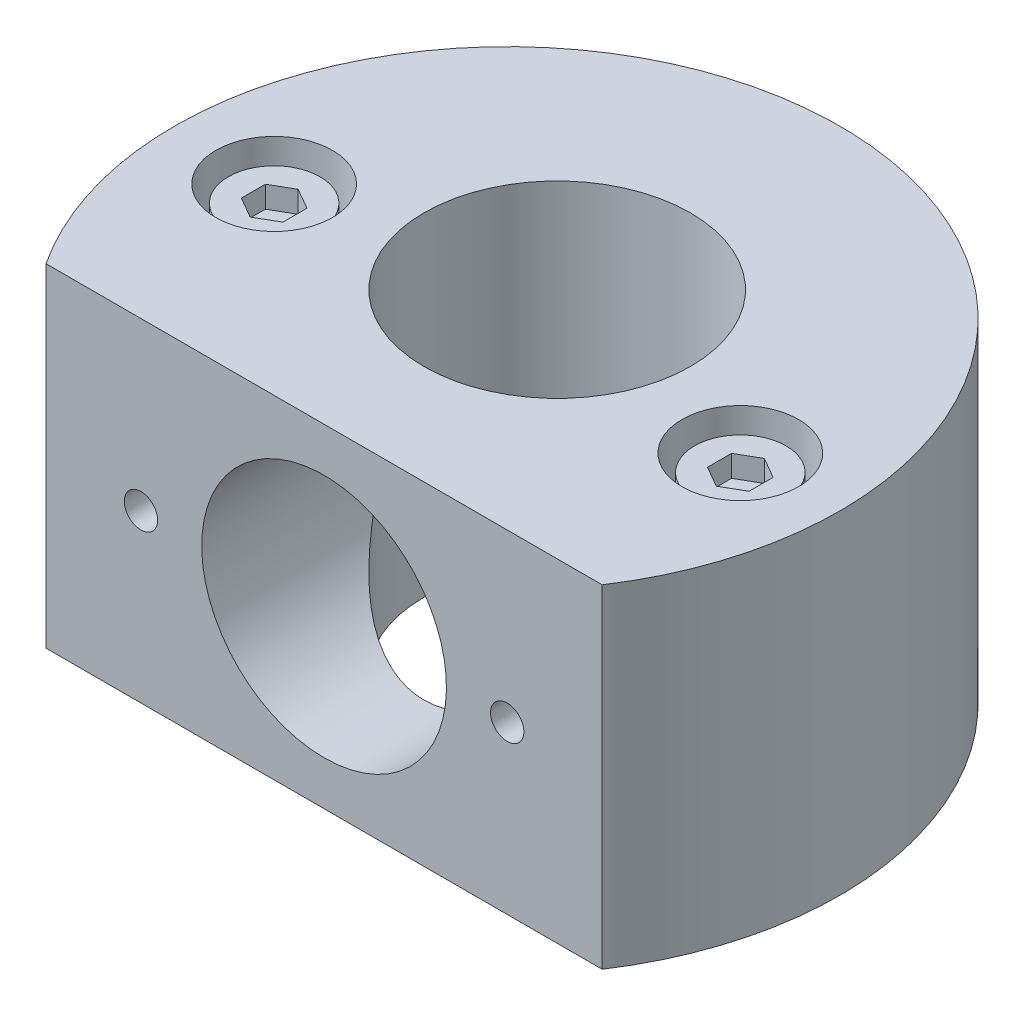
ISO-10303-21;
HEADER;
FILE_DESCRIPTION(('STEP AP214'),'2;1');
FILE_NAME('part.step','',(''),(''),'','','');
FILE_SCHEMA(('AUTOMOTIVE_DESIGN { 1 0 10303 214 1 1 1 1 }'));
ENDSEC;
DATA;
#1=APPLICATION_CONTEXT('core data for automotive mechanical design processes');
#2=APPLICATION_PROTOCOL_DEFINITION('international standard','automotive_design',2000,#1);
#3=PRODUCT_CONTEXT('',#1,'mechanical');
#4=PRODUCT('Part','Part','',(#3));
#5=PRODUCT_RELATED_PRODUCT_CATEGORY('part','',(#4));
#6=PRODUCT_DEFINITION_FORMATION('','',#4);
#7=PRODUCT_DEFINITION_CONTEXT('part definition',#1,'design');
#8=PRODUCT_DEFINITION('design','',#6,#7);
#9=PRODUCT_DEFINITION_SHAPE('','',#8);
#10=(LENGTH_UNIT() NAMED_UNIT(*) SI_UNIT(.MILLI.,.METRE.));
#11=(NAMED_UNIT(*) PLANE_ANGLE_UNIT() SI_UNIT($,.RADIAN.));
#12=(NAMED_UNIT(*) SI_UNIT($,.STERADIAN.) SOLID_ANGLE_UNIT());
#13=UNCERTAINTY_MEASURE_WITH_UNIT(LENGTH_MEASURE(1.E-05),#10,'distance_accuracy_value','');
#14=(GEOMETRIC_REPRESENTATION_CONTEXT(3) GLOBAL_UNCERTAINTY_ASSIGNED_CONTEXT((#13)) GLOBAL_UNIT_ASSIGNED_CONTEXT((#10,
#11,#12)) REPRESENTATION_CONTEXT('',''));
#15=CARTESIAN_POINT('',(0.,0.,0.));
#16=DIRECTION('',(0.,0.,1.));
#17=DIRECTION('',(1.,0.,0.));
#18=AXIS2_PLACEMENT_3D('',#15,#16,#17);
#19=CARTESIAN_POINT('',(-1.39659253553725E-13,20.,0.));
#20=DIRECTION('',(0.,-1.,0.));
#21=DIRECTION('',(1.,0.,0.));
#22=AXIS2_PLACEMENT_3D('',#19,#20,#21);
#23=CYLINDRICAL_SURFACE('',#22,20.);
#24=DIRECTION('',(0.,-1.,0.));
#25=VECTOR('',#24,1.);
#26=CARTESIAN_POINT('',(16.7032930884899,20.,11.));
#27=LINE('',#26,#25);
#28=CARTESIAN_POINT('',(16.7032930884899,20.,11.));
#29=VERTEX_POINT('',#28);
#30=CARTESIAN_POINT('',(16.70329308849,1.55044766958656E-13,11.));
#31=VERTEX_POINT('',#30);
#32=EDGE_CURVE('E238',#29,#31,#27,.T.);
#33=ORIENTED_EDGE('',*,*,#32,.T.);
#34=CARTESIAN_POINT('',(0.,0.,0.));
#35=DIRECTION('',(0.,1.,0.));
#36=DIRECTION('',(-1.,0.,0.));
#37=AXIS2_PLACEMENT_3D('',#34,#35,#36);
#38=CIRCLE('',#37,20.);
#39=CARTESIAN_POINT('',(-16.70329308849,0.,11.));
#40=VERTEX_POINT('',#39);
#41=EDGE_CURVE('E27',#31,#40,#38,.T.);
#42=ORIENTED_EDGE('',*,*,#41,.T.);
#43=DIRECTION('',(0.,-1.,0.));
#44=VECTOR('',#43,1.);
#45=CARTESIAN_POINT('',(-16.7032930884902,20.,11.));
#46=LINE('',#45,#44);
#47=CARTESIAN_POINT('',(-16.7032930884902,20.,11.));
#48=VERTEX_POINT('',#47);
#49=EDGE_CURVE('E240',#48,#40,#46,.T.);
#50=ORIENTED_EDGE('',*,*,#49,.F.);
#51=CARTESIAN_POINT('',(-1.39659253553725E-13,20.,0.));
#52=DIRECTION('',(0.,1.,0.));
#53=DIRECTION('',(-1.,0.,0.));
#54=AXIS2_PLACEMENT_3D('',#51,#52,#53);
#55=CIRCLE('',#54,20.);
#56=EDGE_CURVE('E385',#29,#48,#55,.T.);
#57=ORIENTED_EDGE('',*,*,#56,.F.);
#58=EDGE_LOOP('',(#33,#42,#50,#57));
#59=FACE_BOUND('',#58,.T.);
#60=ADVANCED_FACE('F14',(#59),#23,.T.);
#61=CARTESIAN_POINT('',(10.2,10.,7.));
#62=DIRECTION('',(0.,0.,-1.));
#63=DIRECTION('',(0.,-1.,0.));
#64=AXIS2_PLACEMENT_3D('',#61,#62,#63);
#65=PLANE('',#64);
#66=CARTESIAN_POINT('',(11.,10.,7.));
#67=DIRECTION('',(0.,0.,1.));
#68=DIRECTION('',(0.,1.,0.));
#69=AXIS2_PLACEMENT_3D('',#66,#67,#68);
#70=CIRCLE('',#69,1.);
#71=CARTESIAN_POINT('',(11.,11.,7.));
#72=VERTEX_POINT('',#71);
#73=EDGE_CURVE('E231',#72,#72,#70,.T.);
#74=ORIENTED_EDGE('',*,*,#73,.T.);
#75=EDGE_LOOP('',(#74));
#76=FACE_BOUND('',#75,.T.);
#77=ADVANCED_FACE('F267',(#76),#65,.F.);
#78=CARTESIAN_POINT('',(11.,10.0000000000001,11.));
#79=DIRECTION('',(0.,0.,1.));
#80=DIRECTION('',(0.,1.,0.));
#81=AXIS2_PLACEMENT_3D('',#78,#79,#80);
#82=CYLINDRICAL_SURFACE('',#81,1.);
#83=ORIENTED_EDGE('',*,*,#73,.F.);
#84=EDGE_LOOP('',(#83));
#85=FACE_BOUND('',#84,.T.);
#86=CARTESIAN_POINT('',(11.,10.0000000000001,11.));
#87=DIRECTION('',(0.,0.,-1.));
#88=DIRECTION('',(0.,-1.,0.));
#89=AXIS2_PLACEMENT_3D('',#86,#87,#88);
#90=CIRCLE('',#89,1.);
#91=CARTESIAN_POINT('',(11.,9.00000000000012,11.));
#92=VERTEX_POINT('',#91);
#93=EDGE_CURVE('E223',#92,#92,#90,.F.);
#94=ORIENTED_EDGE('',*,*,#93,.T.);
#95=EDGE_LOOP('',(#94));
#96=FACE_BOUND('',#95,.T.);
#97=ADVANCED_FACE('F270',(#85,#96),#82,.F.);
#98=CARTESIAN_POINT('',(-14.0000000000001,20.,0.));
#99=DIRECTION('',(0.,1.,0.));
#100=DIRECTION('',(-1.,0.,0.));
#101=AXIS2_PLACEMENT_3D('',#98,#99,#100);
#102=CYLINDRICAL_SURFACE('',#101,3.5);
#103=CARTESIAN_POINT('',(-14.,16.,0.));
#104=DIRECTION('',(0.,1.,0.));
#105=DIRECTION('',(-1.,0.,0.));
#106=AXIS2_PLACEMENT_3D('',#103,#104,#105);
#107=CIRCLE('',#106,3.5);
#108=CARTESIAN_POINT('',(-17.5,16.,0.));
#109=VERTEX_POINT('',#108);
#110=EDGE_CURVE('E227',#109,#109,#107,.T.);
#111=ORIENTED_EDGE('',*,*,#110,.F.);
#112=EDGE_LOOP('',(#111));
#113=FACE_BOUND('',#112,.T.);
#114=CARTESIAN_POINT('',(-14.0000000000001,20.,0.));
#115=DIRECTION('',(0.,1.,0.));
#116=DIRECTION('',(-1.,0.,0.));
#117=AXIS2_PLACEMENT_3D('',#114,#115,#116);
#118=CIRCLE('',#117,3.5);
#119=CARTESIAN_POINT('',(-17.5000000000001,20.,0.));
#120=VERTEX_POINT('',#119);
#121=EDGE_CURVE('E448',#120,#120,#118,.T.);
#122=ORIENTED_EDGE('',*,*,#121,.T.);
#123=EDGE_LOOP('',(#122));
#124=FACE_BOUND('',#123,.T.);
#125=ADVANCED_FACE('F275',(#113,#124),#102,.F.);
#126=CARTESIAN_POINT('',(-17.5,16.,0.));
#127=DIRECTION('',(0.,-1.,0.));
#128=DIRECTION('',(1.,0.,0.));
#129=AXIS2_PLACEMENT_3D('',#126,#127,#128);
#130=PLANE('',#129);
#131=CARTESIAN_POINT('',(-14.,16.,0.));
#132=DIRECTION('',(0.,-1.,0.));
#133=DIRECTION('',(1.,0.,0.));
#134=AXIS2_PLACEMENT_3D('',#131,#132,#133);
#135=CIRCLE('',#134,2.75);
#136=CARTESIAN_POINT('',(-11.25,16.,0.));
#137=VERTEX_POINT('',#136);
#138=EDGE_CURVE('E9',#137,#137,#135,.F.);
#139=ORIENTED_EDGE('',*,*,#138,.F.);
#140=EDGE_LOOP('',(#139));
#141=FACE_BOUND('',#140,.T.);
#142=ORIENTED_EDGE('',*,*,#110,.T.);
#143=EDGE_LOOP('',(#142));
#144=FACE_BOUND('',#143,.T.);
#145=ADVANCED_FACE('F272',(#141,#144),#130,.F.);
#146=CARTESIAN_POINT('',(-14.0000000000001,20.,0.));
#147=DIRECTION('',(0.,1.,0.));
#148=DIRECTION('',(-1.,0.,0.));
#149=AXIS2_PLACEMENT_3D('',#146,#147,#148);
#150=CYLINDRICAL_SURFACE('',#149,1.75);
#151=CARTESIAN_POINT('',(-14.,16.,0.));
#152=DIRECTION('',(0.,1.,0.));
#153=DIRECTION('',(-1.,0.,0.));
#154=AXIS2_PLACEMENT_3D('',#151,#152,#153);
#155=CIRCLE('',#154,1.75);
#156=CARTESIAN_POINT('',(-15.75,16.,0.));
#157=VERTEX_POINT('',#156);
#158=EDGE_CURVE('E123',#157,#157,#155,.F.);
#159=ORIENTED_EDGE('',*,*,#158,.F.);
#160=EDGE_LOOP('',(#159));
#161=FACE_BOUND('',#160,.T.);
#162=CARTESIAN_POINT('',(-14.,0.,0.));
#163=DIRECTION('',(0.,1.,0.));
#164=DIRECTION('',(-1.,0.,0.));
#165=AXIS2_PLACEMENT_3D('',#162,#163,#164);
#166=CIRCLE('',#165,1.75);
#167=CARTESIAN_POINT('',(-15.75,-1.09981662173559E-13,0.));
#168=VERTEX_POINT('',#167);
#169=EDGE_CURVE('E451',#168,#168,#166,.T.);
#170=ORIENTED_EDGE('',*,*,#169,.F.);
#171=EDGE_LOOP('',(#170));
#172=FACE_BOUND('',#171,.T.);
#173=ADVANCED_FACE('F265',(#161,#172),#150,.F.);
#174=CARTESIAN_POINT('',(-11.8,10.,7.));
#175=DIRECTION('',(0.,0.,-1.));
#176=DIRECTION('',(0.,-1.,0.));
#177=AXIS2_PLACEMENT_3D('',#174,#175,#176);
#178=PLANE('',#177);
#179=CARTESIAN_POINT('',(-11.,10.,7.));
#180=DIRECTION('',(0.,0.,1.));
#181=DIRECTION('',(0.,1.,0.));
#182=AXIS2_PLACEMENT_3D('',#179,#180,#181);
#183=CIRCLE('',#182,1.);
#184=CARTESIAN_POINT('',(-11.,11.,7.));
#185=VERTEX_POINT('',#184);
#186=EDGE_CURVE('E234',#185,#185,#183,.T.);
#187=ORIENTED_EDGE('',*,*,#186,.T.);
#188=EDGE_LOOP('',(#187));
#189=FACE_BOUND('',#188,.T.);
#190=ADVANCED_FACE('F261',(#189),#178,.F.);
#191=CARTESIAN_POINT('',(-11.,10.,11.));
#192=DIRECTION('',(0.,0.,1.));
#193=DIRECTION('',(0.,1.,0.));
#194=AXIS2_PLACEMENT_3D('',#191,#192,#193);
#195=CYLINDRICAL_SURFACE('',#194,1.);
#196=ORIENTED_EDGE('',*,*,#186,.F.);
#197=EDGE_LOOP('',(#196));
#198=FACE_BOUND('',#197,.T.);
#199=CARTESIAN_POINT('',(-11.,10.,11.));
#200=DIRECTION('',(0.,0.,-1.));
#201=DIRECTION('',(0.,-1.,0.));
#202=AXIS2_PLACEMENT_3D('',#199,#200,#201);
#203=CIRCLE('',#202,1.);
#204=CARTESIAN_POINT('',(-11.,9.,11.));
#205=VERTEX_POINT('',#204);
#206=EDGE_CURVE('E228',#205,#205,#203,.F.);
#207=ORIENTED_EDGE('',*,*,#206,.T.);
#208=EDGE_LOOP('',(#207));
#209=FACE_BOUND('',#208,.T.);
#210=ADVANCED_FACE('F264',(#198,#209),#195,.F.);
#211=CARTESIAN_POINT('',(0.,0.,0.));
#212=DIRECTION('',(0.,1.,0.));
#213=DIRECTION('',(-1.,0.,0.));
#214=AXIS2_PLACEMENT_3D('',#211,#212,#213);
#215=PLANE('',#214);
#216=ORIENTED_EDGE('',*,*,#41,.F.);
#217=DIRECTION('',(1.,0.,0.));
#218=VECTOR('',#217,1.);
#219=CARTESIAN_POINT('',(16.70329308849,1.55044766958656E-13,11.));
#220=LINE('',#219,#218);
#221=EDGE_CURVE('E388',#40,#31,#220,.T.);
#222=ORIENTED_EDGE('',*,*,#221,.F.);
#223=EDGE_LOOP('',(#216,#222));
#224=FACE_BOUND('',#223,.T.);
#225=ORIENTED_EDGE('',*,*,#169,.T.);
#226=EDGE_LOOP('',(#225));
#227=FACE_BOUND('',#226,.T.);
#228=CARTESIAN_POINT('',(0.,0.,-3.));
#229=DIRECTION('',(0.,1.,0.));
#230=DIRECTION('',(-1.,0.,0.));
#231=AXIS2_PLACEMENT_3D('',#228,#229,#230);
#232=CIRCLE('',#231,8.);
#233=CARTESIAN_POINT('',(-8.,0.,-3.));
#234=VERTEX_POINT('',#233);
#235=EDGE_CURVE('E243',#234,#234,#232,.T.);
#236=ORIENTED_EDGE('',*,*,#235,.T.);
#237=EDGE_LOOP('',(#236));
#238=FACE_BOUND('',#237,.T.);
#239=CARTESIAN_POINT('',(14.,0.,0.));
#240=DIRECTION('',(0.,1.,0.));
#241=DIRECTION('',(-1.,0.,0.));
#242=AXIS2_PLACEMENT_3D('',#239,#240,#241);
#243=CIRCLE('',#242,1.75);
#244=CARTESIAN_POINT('',(12.25,0.,0.));
#245=VERTEX_POINT('',#244);
#246=EDGE_CURVE('E398',#245,#245,#243,.T.);
#247=ORIENTED_EDGE('',*,*,#246,.T.);
#248=EDGE_LOOP('',(#247));
#249=FACE_BOUND('',#248,.T.);
#250=ADVANCED_FACE('F414',(#224,#227,#238,#249),#215,.F.);
#251=CARTESIAN_POINT('',(-1.39659253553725E-13,20.,0.));
#252=DIRECTION('',(0.,1.,0.));
#253=DIRECTION('',(-1.,0.,0.));
#254=AXIS2_PLACEMENT_3D('',#251,#252,#253);
#255=PLANE('',#254);
#256=ORIENTED_EDGE('',*,*,#121,.F.);
#257=EDGE_LOOP('',(#256));
#258=FACE_BOUND('',#257,.T.);
#259=DIRECTION('',(1.,0.,0.));
#260=VECTOR('',#259,1.);
#261=CARTESIAN_POINT('',(16.7032930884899,20.,11.));
#262=LINE('',#261,#260);
#263=EDGE_CURVE('E387',#48,#29,#262,.T.);
#264=ORIENTED_EDGE('',*,*,#263,.T.);
#265=ORIENTED_EDGE('',*,*,#56,.T.);
#266=EDGE_LOOP('',(#264,#265));
#267=FACE_BOUND('',#266,.T.);
#268=CARTESIAN_POINT('',(-1.39659253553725E-13,20.,-3.00000000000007));
#269=DIRECTION('',(0.,1.,0.));
#270=DIRECTION('',(-1.,0.,0.));
#271=AXIS2_PLACEMENT_3D('',#268,#269,#270);
#272=CIRCLE('',#271,8.);
#273=CARTESIAN_POINT('',(-8.00000000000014,19.9999999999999,-3.00000000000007));
#274=VERTEX_POINT('',#273);
#275=EDGE_CURVE('E462',#274,#274,#272,.T.);
#276=ORIENTED_EDGE('',*,*,#275,.F.);
#277=EDGE_LOOP('',(#276));
#278=FACE_BOUND('',#277,.T.);
#279=CARTESIAN_POINT('',(13.9999999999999,20.,0.));
#280=DIRECTION('',(0.,1.,0.));
#281=DIRECTION('',(-1.,0.,0.));
#282=AXIS2_PLACEMENT_3D('',#279,#280,#281);
#283=CIRCLE('',#282,3.5);
#284=CARTESIAN_POINT('',(10.4999999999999,20.,0.));
#285=VERTEX_POINT('',#284);
#286=EDGE_CURVE('E390',#285,#285,#283,.T.);
#287=ORIENTED_EDGE('',*,*,#286,.F.);
#288=EDGE_LOOP('',(#287));
#289=FACE_BOUND('',#288,.T.);
#290=ADVANCED_FACE('F412',(#258,#267,#278,#289),#255,.T.);
#291=CARTESIAN_POINT('',(16.7032930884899,20.,11.));
#292=DIRECTION('',(0.,0.,-1.));
#293=DIRECTION('',(0.,-1.,0.));
#294=AXIS2_PLACEMENT_3D('',#291,#292,#293);
#295=PLANE('',#294);
#296=ORIENTED_EDGE('',*,*,#93,.F.);
#297=EDGE_LOOP('',(#296));
#298=FACE_BOUND('',#297,.T.);
#299=ORIENTED_EDGE('',*,*,#206,.F.);
#300=EDGE_LOOP('',(#299));
#301=FACE_BOUND('',#300,.T.);
#302=CARTESIAN_POINT('',(0.,10.,11.));
#303=DIRECTION('',(0.,0.,-1.));
#304=DIRECTION('',(0.,-1.,0.));
#305=AXIS2_PLACEMENT_3D('',#302,#303,#304);
#306=CIRCLE('',#305,7.35);
#307=CARTESIAN_POINT('',(0.,2.65,11.));
#308=VERTEX_POINT('',#307);
#309=EDGE_CURVE('E392',#308,#308,#306,.F.);
#310=ORIENTED_EDGE('',*,*,#309,.F.);
#311=EDGE_LOOP('',(#310));
#312=FACE_BOUND('',#311,.T.);
#313=ORIENTED_EDGE('',*,*,#49,.T.);
#314=ORIENTED_EDGE('',*,*,#221,.T.);
#315=ORIENTED_EDGE('',*,*,#32,.F.);
#316=ORIENTED_EDGE('',*,*,#263,.F.);
#317=EDGE_LOOP('',(#313,#314,#315,#316));
#318=FACE_BOUND('',#317,.T.);
#319=ADVANCED_FACE('F259',(#298,#301,#312,#318),#295,.F.);
#320=CARTESIAN_POINT('',(0.,10.,11.));
#321=DIRECTION('',(0.,0.,-1.));
#322=DIRECTION('',(0.,-1.,0.));
#323=AXIS2_PLACEMENT_3D('',#320,#321,#322);
#324=CYLINDRICAL_SURFACE('',#323,7.35);
#325=ORIENTED_EDGE('',*,*,#309,.T.);
#326=EDGE_LOOP('',(#325));
#327=FACE_BOUND('',#326,.T.);
#328=CARTESIAN_POINT('',(0.,2.65,5.));
#329=CARTESIAN_POINT('',(0.169214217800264,2.65000038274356,4.99999962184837));
#330=CARTESIAN_POINT('',(0.338433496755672,2.65585414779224,4.99462049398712));
#331=CARTESIAN_POINT('',(0.675394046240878,2.67914828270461,4.97322700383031));
#332=CARTESIAN_POINT('',(0.843135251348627,2.69658916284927,4.95721217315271));
#333=CARTESIAN_POINT('',(1.17581350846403,2.74271559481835,4.91489688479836));
#334=CARTESIAN_POINT('',(1.34074932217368,2.77140598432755,4.88859200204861));
#335=CARTESIAN_POINT('',(1.66650640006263,2.83948657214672,4.82625489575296));
#336=CARTESIAN_POINT('',(1.82732761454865,2.87887689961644,4.79022255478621));
#337=CARTESIAN_POINT('',(2.14278775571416,2.96738913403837,4.70939631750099));
#338=CARTESIAN_POINT('',(2.29746048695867,3.01644507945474,4.66466183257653));
#339=CARTESIAN_POINT('',(2.60096870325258,3.12370674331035,4.56706136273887));
#340=CARTESIAN_POINT('',(2.74980200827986,3.18191583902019,4.51419237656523));
#341=CARTESIAN_POINT('',(3.18660704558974,3.36914491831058,4.34458415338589));
#342=CARTESIAN_POINT('',(3.46505554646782,3.51081605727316,4.21679833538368));
#343=CARTESIAN_POINT('',(3.91422148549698,3.77523487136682,3.980175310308));
#344=CARTESIAN_POINT('',(4.09228448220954,3.8910059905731,3.87706968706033));
#345=CARTESIAN_POINT('',(4.43421087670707,4.13448454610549,3.66172187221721));
#346=CARTESIAN_POINT('',(4.59807321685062,4.26219287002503,3.54947900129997));
#347=CARTESIAN_POINT('',(4.91186153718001,4.52838514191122,3.3175774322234));
#348=CARTESIAN_POINT('',(5.06175642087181,4.66689192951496,3.19790313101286));
#349=CARTESIAN_POINT('',(5.3474015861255,4.95334749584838,2.95320503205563));
#350=CARTESIAN_POINT('',(5.48315363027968,5.1012950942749,2.82818190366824));
#351=CARTESIAN_POINT('',(5.74394549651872,5.40964438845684,2.57147881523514));
#352=CARTESIAN_POINT('',(5.8686424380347,5.57026208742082,2.43971084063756));
#353=CARTESIAN_POINT('',(6.10379478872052,5.90033307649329,2.17446585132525));
#354=CARTESIAN_POINT('',(6.21424695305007,6.06978836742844,2.04098845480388));
#355=CARTESIAN_POINT('',(6.42087302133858,6.4173065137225,1.77500580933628));
#356=CARTESIAN_POINT('',(6.51707327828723,6.59535265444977,1.64249920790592));
#357=CARTESIAN_POINT('',(6.69539330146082,6.96098946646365,1.38139833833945));
#358=CARTESIAN_POINT('',(6.77752050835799,7.14857502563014,1.25280203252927));
#359=CARTESIAN_POINT('',(6.9255818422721,7.53023994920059,1.00704054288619));
#360=CARTESIAN_POINT('',(6.9918576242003,7.72405500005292,0.889674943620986));
#361=CARTESIAN_POINT('',(7.10974810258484,8.12447346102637,0.669737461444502));
#362=CARTESIAN_POINT('',(7.16136124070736,8.33107822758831,0.567167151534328));
#363=CARTESIAN_POINT('',(7.24065836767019,8.7238926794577,0.402916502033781));
#364=CARTESIAN_POINT('',(7.27088532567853,8.90784393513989,0.337281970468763));
#365=CARTESIAN_POINT('',(7.30590044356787,9.19048368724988,0.259544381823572));
#366=CARTESIAN_POINT('',(7.31584557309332,9.28569908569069,0.237098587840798));
#367=CARTESIAN_POINT('',(7.33206997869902,9.47794740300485,0.200181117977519));
#368=CARTESIAN_POINT('',(7.33835142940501,9.57497920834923,0.185704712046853));
#369=CARTESIAN_POINT('',(7.34710784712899,9.77134869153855,0.165459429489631));
#370=CARTESIAN_POINT('',(7.34953485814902,9.87070004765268,0.159800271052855));
#371=CARTESIAN_POINT('',(7.35034353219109,10.0695060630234,0.157918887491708));
#372=CARTESIAN_POINT('',(7.34872533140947,10.1689607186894,0.16169634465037));
#373=CARTESIAN_POINT('',(7.3414976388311,10.3670888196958,0.178441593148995));
#374=CARTESIAN_POINT('',(7.33588204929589,10.465760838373,0.19142342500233));
#375=CARTESIAN_POINT('',(7.32084311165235,10.6613627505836,0.225772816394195));
#376=CARTESIAN_POINT('',(7.31141713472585,10.7582913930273,0.247146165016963));
#377=CARTESIAN_POINT('',(7.27200297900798,11.0951300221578,0.335064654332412));
#378=CARTESIAN_POINT('',(7.23250841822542,11.3289838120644,0.420962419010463));
#379=CARTESIAN_POINT('',(7.15936039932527,11.6671932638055,0.570250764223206));
#380=CARTESIAN_POINT('',(7.13257917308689,11.7780846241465,0.62357273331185));
#381=CARTESIAN_POINT('',(7.0746626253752,11.9960749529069,0.735386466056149));
#382=CARTESIAN_POINT('',(7.04352855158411,12.103174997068,0.79387674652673));
#383=CARTESIAN_POINT('',(6.94345443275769,12.420873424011,0.975878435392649));
#384=CARTESIAN_POINT('',(6.86821638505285,12.6261856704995,1.10512823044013));
#385=CARTESIAN_POINT('',(6.70201264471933,13.0252640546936,1.37124388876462));
#386=CARTESIAN_POINT('',(6.61103296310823,13.219019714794,1.5081164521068));
#387=CARTESIAN_POINT('',(6.41348216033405,13.5965511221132,1.78499959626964));
#388=CARTESIAN_POINT('',(6.3068888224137,13.7803121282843,1.92501440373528));
#389=CARTESIAN_POINT('',(6.07815995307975,14.1380568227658,2.20467299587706));
#390=CARTESIAN_POINT('',(5.95602961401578,14.3120437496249,2.34431688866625));
#391=CARTESIAN_POINT('',(5.68518178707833,14.6641751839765,2.6321325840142));
#392=CARTESIAN_POINT('',(5.53510219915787,14.8414788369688,2.78005769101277));
#393=CARTESIAN_POINT('',(5.21589046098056,15.183797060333,3.06967466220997));
#394=CARTESIAN_POINT('',(5.04675287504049,15.3488081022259,3.21136473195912));
#395=CARTESIAN_POINT('',(4.6896452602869,15.6644816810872,3.48519195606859));
#396=CARTESIAN_POINT('',(4.50173280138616,15.8151854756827,3.61735629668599));
#397=CARTESIAN_POINT('',(4.10664214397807,16.1005973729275,3.86952180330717));
#398=CARTESIAN_POINT('',(3.89947679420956,16.2353160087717,3.98953097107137));
#399=CARTESIAN_POINT('',(3.54405692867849,16.4411125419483,4.17385251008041));
#400=CARTESIAN_POINT('',(3.40130891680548,16.5176910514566,4.24270810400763));
#401=CARTESIAN_POINT('',(3.10840513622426,16.6623553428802,4.37316077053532));
#402=CARTESIAN_POINT('',(2.95825158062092,16.7304436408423,4.43475999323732));
#403=CARTESIAN_POINT('',(2.65102130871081,16.8572735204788,4.54976728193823));
#404=CARTESIAN_POINT('',(2.4939453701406,16.916016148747,4.60317626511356));
#405=CARTESIAN_POINT('',(2.1736488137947,17.0232652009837,4.70086125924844));
#406=CARTESIAN_POINT('',(2.01043120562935,17.0717765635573,4.74514167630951));
#407=CARTESIAN_POINT('',(1.67736773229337,17.1581264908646,4.82406321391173));
#408=CARTESIAN_POINT('',(1.50747794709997,17.1958726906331,4.85862088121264));
#409=CARTESIAN_POINT('',(1.16362624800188,17.259410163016,4.91684115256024));
#410=CARTESIAN_POINT('',(0.98966434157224,17.2852014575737,4.94050377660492));
#411=CARTESIAN_POINT('',(0.639256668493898,17.3242686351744,4.97636200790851));
#412=CARTESIAN_POINT('',(0.462812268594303,17.3375511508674,4.9885636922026));
#413=CARTESIAN_POINT('',(0.109012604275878,17.3513227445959,5.00121480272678));
#414=CARTESIAN_POINT('',(-0.068342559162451,17.3518132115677,5.00166550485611));
#415=CARTESIAN_POINT('',(-0.401224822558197,17.3406999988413,4.99145626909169));
#416=CARTESIAN_POINT('',(-0.556843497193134,17.3305253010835,4.98210910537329));
#417=CARTESIAN_POINT('',(-0.866383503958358,17.3004153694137,4.95446596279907));
#418=CARTESIAN_POINT('',(-1.02030426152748,17.2804769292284,4.93616704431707));
#419=CARTESIAN_POINT('',(-1.32528369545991,17.2311810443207,4.89096842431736));
#420=CARTESIAN_POINT('',(-1.47634331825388,17.2018267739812,4.86407162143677));
#421=CARTESIAN_POINT('',(-1.77478718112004,17.1341472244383,4.80213884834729));
#422=CARTESIAN_POINT('',(-1.92216999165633,17.0958185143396,4.7670997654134));
#423=CARTESIAN_POINT('',(-2.21375221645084,17.0103556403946,4.68910123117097));
#424=CARTESIAN_POINT('',(-2.35791068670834,16.9631448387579,4.64607289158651));
#425=CARTESIAN_POINT('',(-2.64104673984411,16.8607628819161,4.55295420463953));
#426=CARTESIAN_POINT('',(-2.78002232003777,16.8055886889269,4.50286116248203));
#427=CARTESIAN_POINT('',(-3.1884229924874,16.6290502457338,4.34297594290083));
#428=CARTESIAN_POINT('',(-3.44945049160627,16.4966316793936,4.2235424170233));
#429=CARTESIAN_POINT('',(-3.88301252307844,16.2442572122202,3.99756775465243));
#430=CARTESIAN_POINT('',(-4.06116086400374,16.1297073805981,3.89548214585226));
#431=CARTESIAN_POINT('',(-4.40337666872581,15.8886787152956,3.68213194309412));
#432=CARTESIAN_POINT('',(-4.56744280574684,15.762198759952,3.57086648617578));
#433=CARTESIAN_POINT('',(-4.88178351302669,15.4984460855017,3.34083836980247));
#434=CARTESIAN_POINT('',(-5.03202451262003,15.3611485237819,3.22205858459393));
#435=CARTESIAN_POINT('',(-5.31845553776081,15.0771254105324,2.97907098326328));
#436=CARTESIAN_POINT('',(-5.45464744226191,14.9304011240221,2.85486389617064));
#437=CARTESIAN_POINT('',(-5.71629724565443,14.6247031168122,2.59983001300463));
#438=CARTESIAN_POINT('',(-5.84142804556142,14.465522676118,2.46891626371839));
#439=CARTESIAN_POINT('',(-6.07756766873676,14.1384032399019,2.2052366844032));
#440=CARTESIAN_POINT('',(-6.18857344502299,13.9704623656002,2.07247046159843));
#441=CARTESIAN_POINT('',(-6.3964339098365,13.6260888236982,1.80769097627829));
#442=CARTESIAN_POINT('',(-6.49331476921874,13.4496726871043,1.67567676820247));
#443=CARTESIAN_POINT('',(-6.67314699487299,13.0874738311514,1.41521343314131));
#444=CARTESIAN_POINT('',(-6.75610523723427,12.9016957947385,1.28676257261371));
#445=CARTESIAN_POINT('',(-6.90743477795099,12.5202665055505,1.03836055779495));
#446=CARTESIAN_POINT('',(-6.97587912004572,12.3246711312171,0.918368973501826));
#447=CARTESIAN_POINT('',(-7.09780485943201,11.9204930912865,0.692900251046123));
#448=CARTESIAN_POINT('',(-7.15128282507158,11.711907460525,0.587426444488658));
#449=CARTESIAN_POINT('',(-7.23364623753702,11.3155070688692,0.417862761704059));
#450=CARTESIAN_POINT('',(-7.26514519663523,11.1300264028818,0.349805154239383));
#451=CARTESIAN_POINT('',(-7.30191572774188,10.8448059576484,0.268473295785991));
#452=CARTESIAN_POINT('',(-7.31241977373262,10.7486878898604,0.244838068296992));
#453=CARTESIAN_POINT('',(-7.32969938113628,10.5545184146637,0.205615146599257));
#454=CARTESIAN_POINT('',(-7.33647722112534,10.4564682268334,0.190022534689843));
#455=CARTESIAN_POINT('',(-7.34615828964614,10.2578258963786,0.167666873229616));
#456=CARTESIAN_POINT('',(-7.34900852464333,10.1572172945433,0.161024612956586));
#457=CARTESIAN_POINT('',(-7.35055703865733,9.95579708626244,0.157422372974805));
#458=CARTESIAN_POINT('',(-7.34925551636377,9.85498548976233,0.160461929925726));
#459=CARTESIAN_POINT('',(-7.34254496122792,9.65409827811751,0.176019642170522));
#460=CARTESIAN_POINT('',(-7.33712998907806,9.55402393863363,0.188551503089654));
#461=CARTESIAN_POINT('',(-7.32237613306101,9.3556181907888,0.222289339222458));
#462=CARTESIAN_POINT('',(-7.31303448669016,9.25728806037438,0.243501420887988));
#463=CARTESIAN_POINT('',(-7.27429966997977,8.92058778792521,0.33002207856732));
#464=CARTESIAN_POINT('',(-7.23557984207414,8.68808851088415,0.41440722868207));
#465=CARTESIAN_POINT('',(-7.16373506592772,8.35175417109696,0.56145079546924));
#466=CARTESIAN_POINT('',(-7.13741276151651,8.24146209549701,0.614027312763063));
#467=CARTESIAN_POINT('',(-7.08046166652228,8.02463287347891,0.724368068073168));
#468=CARTESIAN_POINT('',(-7.04983408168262,7.91809468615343,0.782130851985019));
#469=CARTESIAN_POINT('',(-6.95135867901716,7.60204451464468,0.961980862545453));
#470=CARTESIAN_POINT('',(-6.87728635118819,7.39777571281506,1.08984720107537));
#471=CARTESIAN_POINT('',(-6.71362417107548,7.00069314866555,1.35332467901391));
#472=CARTESIAN_POINT('',(-6.62402043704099,6.80788984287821,1.48894267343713));
#473=CARTESIAN_POINT('',(-6.4294514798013,6.43216408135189,1.76345544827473));
#474=CARTESIAN_POINT('',(-6.32446460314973,6.24925605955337,1.90235461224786));
#475=CARTESIAN_POINT('',(-6.09919122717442,5.89308679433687,2.17994551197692));
#476=CARTESIAN_POINT('',(-5.97890986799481,5.71982233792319,2.31863730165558));
#477=CARTESIAN_POINT('',(-5.71175892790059,5.36846670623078,2.60512228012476));
#478=CARTESIAN_POINT('',(-5.5634937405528,5.19123609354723,2.75267585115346));
#479=CARTESIAN_POINT('',(-5.24810796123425,4.8488809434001,3.04178338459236));
#480=CARTESIAN_POINT('',(-5.08098203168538,4.68375985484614,3.18333563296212));
#481=CARTESIAN_POINT('',(-4.72805615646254,4.36759775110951,3.45718532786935));
#482=CARTESIAN_POINT('',(-4.54231043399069,4.21651818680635,3.58950784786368));
#483=CARTESIAN_POINT('',(-4.15171000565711,3.93004312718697,3.84232034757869));
#484=CARTESIAN_POINT('',(-3.94686769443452,3.7946375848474,3.96281789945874));
#485=CARTESIAN_POINT('',(-3.59400918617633,3.58661299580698,4.14896559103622));
#486=CARTESIAN_POINT('',(-3.45139712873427,3.50868013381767,4.2189829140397));
#487=CARTESIAN_POINT('',(-3.15863720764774,3.36129907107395,4.35179078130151));
#488=CARTESIAN_POINT('',(-3.00849139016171,3.2918485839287,4.41458327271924));
#489=CARTESIAN_POINT('',(-2.70123130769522,3.16233779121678,4.53195702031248));
#490=CARTESIAN_POINT('',(-2.54412212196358,3.1022707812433,4.58654413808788));
#491=CARTESIAN_POINT('',(-2.22353790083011,2.99235551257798,4.68661591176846));
#492=CARTESIAN_POINT('',(-2.06006323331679,2.94250666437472,4.73210109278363));
#493=CARTESIAN_POINT('',(-1.74234091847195,2.85777675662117,4.80951878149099));
#494=CARTESIAN_POINT('',(-1.58854637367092,2.82196483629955,4.8422914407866));
#495=CARTESIAN_POINT('',(-1.27740141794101,2.76011772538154,4.89893923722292));
#496=CARTESIAN_POINT('',(-1.12005152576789,2.73408111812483,4.92281566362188));
#497=CARTESIAN_POINT('',(-0.802894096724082,2.69223437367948,4.96121027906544));
#498=CARTESIAN_POINT('',(-0.643087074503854,2.67642212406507,4.97573040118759));
#499=CARTESIAN_POINT('',(-0.322188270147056,2.6553045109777,4.9951256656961));
#500=CARTESIAN_POINT('',(-0.16109642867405,2.64999963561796,5.00000036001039));
#501=CARTESIAN_POINT('',(0.,2.65,5.));
#502=B_SPLINE_CURVE_WITH_KNOTS('',3,(#328,#329,#330,#331,#332,#333,#334,#335,#336,#337,#338,
#339,#340,#341,#342,#343,#344,#345,#346,#347,#348,#349,#350,#351,#352,#353,#354,#355,#356,#357,
#358,#359,#360,#361,#362,#363,#364,#365,#366,#367,#368,#369,#370,#371,#372,#373,#374,#375,#376,
#377,#378,#379,#380,#381,#382,#383,#384,#385,#386,#387,#388,#389,#390,#391,#392,#393,#394,#395,
#396,#397,#398,#399,#400,#401,#402,#403,#404,#405,#406,#407,#408,#409,#410,#411,#412,#413,#414,
#415,#416,#417,#418,#419,#420,#421,#422,#423,#424,#425,#426,#427,#428,#429,#430,#431,#432,#433,
#434,#435,#436,#437,#438,#439,#440,#441,#442,#443,#444,#445,#446,#447,#448,#449,#450,#451,#452,
#453,#454,#455,#456,#457,#458,#459,#460,#461,#462,#463,#464,#465,#466,#467,#468,#469,#470,#471,
#472,#473,#474,#475,#476,#477,#478,#479,#480,#481,#482,#483,#484,#485,#486,#487,#488,#489,#490,
#491,#492,#493,#494,#495,#496,#497,#498,#499,#500,#501),.UNSPECIFIED.,.T.,.F.,(4,2,2,2,2,2,2,2,
2,2,2,2,2,2,2,2,2,2,2,2,2,2,2,2,2,2,2,2,2,2,2,2,2,2,2,2,2,2,2,2,2,2,2,2,2,2,2,2,2,2,2,2,2,2,2,2,
2,2,2,2,2,2,2,2,2,2,2,2,2,2,2,2,2,2,2,2,2,2,2,2,2,2,2,2,2,2,4),(0.,0.50746677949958,
1.01495590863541,1.52266351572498,2.0303772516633,2.53473922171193,3.03928772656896,
4.04783787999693,4.75530520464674,5.46282517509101,6.17188447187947,6.88085529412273,
7.60715284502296,8.33361554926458,9.05871773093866,9.78343534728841,10.4907404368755,
11.1981206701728,11.7888008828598,12.0834442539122,12.3779125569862,12.6760166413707,
12.9741106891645,13.2726604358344,13.5714165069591,14.3231839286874,14.7008789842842,
15.0784660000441,15.8393031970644,16.6008200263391,17.3634311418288,18.1257880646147,
18.9510287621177,19.7765054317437,20.5995243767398,21.4219979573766,21.9496085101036,
22.4770623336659,23.0044570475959,23.5315966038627,24.063131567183,24.594665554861,
25.1259175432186,25.657111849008,26.1252393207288,26.5935206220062,27.0616442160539,
27.5299470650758,28.0024931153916,28.4752199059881,29.4202614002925,30.1247720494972,
30.829349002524,31.5355940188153,32.2417444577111,32.9644745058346,33.6873601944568,
34.4088890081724,35.1300604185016,35.8475114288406,36.5651268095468,37.1631122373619,
37.461375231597,37.759455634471,38.0615197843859,38.3635694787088,38.6660561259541,
38.9687559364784,39.7148923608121,40.0897648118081,40.4645324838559,41.2197001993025,
41.9755463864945,42.7324669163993,43.4891337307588,44.3106977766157,45.1324949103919,
45.9519647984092,46.770906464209,47.3013357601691,47.8316217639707,48.3615271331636,
48.8914019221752,49.3746712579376,49.8578705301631,50.3409699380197,50.8240917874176),.UNSPECIFIED.);
#503=CARTESIAN_POINT('',(0.,2.65,5.));
#504=VERTEX_POINT('',#503);
#505=EDGE_CURVE('E237',#504,#504,#502,.T.);
#506=ORIENTED_EDGE('',*,*,#505,.F.);
#507=EDGE_LOOP('',(#506));
#508=FACE_BOUND('',#507,.T.);
#509=ADVANCED_FACE('F255',(#327,#508),#324,.F.);
#510=CARTESIAN_POINT('',(-1.39659253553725E-13,20.,-3.00000000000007));
#511=DIRECTION('',(0.,-1.,0.));
#512=DIRECTION('',(1.,0.,0.));
#513=AXIS2_PLACEMENT_3D('',#510,#511,#512);
#514=CYLINDRICAL_SURFACE('',#513,8.);
#515=ORIENTED_EDGE('',*,*,#235,.F.);
#516=EDGE_LOOP('',(#515));
#517=FACE_BOUND('',#516,.T.);
#518=ORIENTED_EDGE('',*,*,#275,.T.);
#519=EDGE_LOOP('',(#518));
#520=FACE_BOUND('',#519,.T.);
#521=ORIENTED_EDGE('',*,*,#505,.T.);
#522=EDGE_LOOP('',(#521));
#523=FACE_BOUND('',#522,.T.);
#524=ADVANCED_FACE('F252',(#517,#520,#523),#514,.F.);
#525=CARTESIAN_POINT('',(13.9999999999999,20.,0.));
#526=DIRECTION('',(0.,1.,0.));
#527=DIRECTION('',(-1.,0.,0.));
#528=AXIS2_PLACEMENT_3D('',#525,#526,#527);
#529=CYLINDRICAL_SURFACE('',#528,3.5);
#530=CARTESIAN_POINT('',(14.,16.,0.));
#531=DIRECTION('',(0.,1.,0.));
#532=DIRECTION('',(-1.,0.,0.));
#533=AXIS2_PLACEMENT_3D('',#530,#531,#532);
#534=CIRCLE('',#533,3.5);
#535=CARTESIAN_POINT('',(10.5,16.,0.));
#536=VERTEX_POINT('',#535);
#537=EDGE_CURVE('E224',#536,#536,#534,.T.);
#538=ORIENTED_EDGE('',*,*,#537,.F.);
#539=EDGE_LOOP('',(#538));
#540=FACE_BOUND('',#539,.T.);
#541=ORIENTED_EDGE('',*,*,#286,.T.);
#542=EDGE_LOOP('',(#541));
#543=FACE_BOUND('',#542,.T.);
#544=ADVANCED_FACE('F281',(#540,#543),#529,.F.);
#545=CARTESIAN_POINT('',(10.5,16.,0.));
#546=DIRECTION('',(0.,-1.,0.));
#547=DIRECTION('',(1.,0.,0.));
#548=AXIS2_PLACEMENT_3D('',#545,#546,#547);
#549=PLANE('',#548);
#550=CARTESIAN_POINT('',(14.,16.,0.));
#551=DIRECTION('',(0.,-1.,0.));
#552=DIRECTION('',(1.,0.,0.));
#553=AXIS2_PLACEMENT_3D('',#550,#551,#552);
#554=CIRCLE('',#553,2.75);
#555=CARTESIAN_POINT('',(16.75,16.,0.));
#556=VERTEX_POINT('',#555);
#557=EDGE_CURVE('E21',#556,#556,#554,.F.);
#558=ORIENTED_EDGE('',*,*,#557,.F.);
#559=EDGE_LOOP('',(#558));
#560=FACE_BOUND('',#559,.T.);
#561=ORIENTED_EDGE('',*,*,#537,.T.);
#562=EDGE_LOOP('',(#561));
#563=FACE_BOUND('',#562,.T.);
#564=ADVANCED_FACE('F277',(#560,#563),#549,.F.);
#565=CARTESIAN_POINT('',(13.9999999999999,20.,0.));
#566=DIRECTION('',(0.,1.,0.));
#567=DIRECTION('',(-1.,0.,0.));
#568=AXIS2_PLACEMENT_3D('',#565,#566,#567);
#569=CYLINDRICAL_SURFACE('',#568,1.75);
#570=CARTESIAN_POINT('',(14.,16.,0.));
#571=DIRECTION('',(0.,1.,0.));
#572=DIRECTION('',(-1.,0.,0.));
#573=AXIS2_PLACEMENT_3D('',#570,#571,#572);
#574=CIRCLE('',#573,1.75);
#575=CARTESIAN_POINT('',(12.25,16.,0.));
#576=VERTEX_POINT('',#575);
#577=EDGE_CURVE('E220',#576,#576,#574,.F.);
#578=ORIENTED_EDGE('',*,*,#577,.F.);
#579=EDGE_LOOP('',(#578));
#580=FACE_BOUND('',#579,.T.);
#581=ORIENTED_EDGE('',*,*,#246,.F.);
#582=EDGE_LOOP('',(#581));
#583=FACE_BOUND('',#582,.T.);
#584=ADVANCED_FACE('F280',(#580,#583),#569,.F.);
#585=CARTESIAN_POINT('',(14.,-3.9999999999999,0.));
#586=DIRECTION('',(0.,1.,0.));
#587=DIRECTION('',(-1.,0.,0.));
#588=AXIS2_PLACEMENT_3D('',#585,#586,#587);
#589=PLANE('',#588);
#590=CARTESIAN_POINT('',(14.,-3.9999999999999,0.));
#591=DIRECTION('',(0.,1.,0.));
#592=DIRECTION('',(-1.,0.,0.));
#593=AXIS2_PLACEMENT_3D('',#590,#591,#592);
#594=CIRCLE('',#593,1.5);
#595=CARTESIAN_POINT('',(12.5,-3.99999999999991,0.));
#596=VERTEX_POINT('',#595);
#597=EDGE_CURVE('E212',#596,#596,#594,.T.);
#598=ORIENTED_EDGE('',*,*,#597,.F.);
#599=EDGE_LOOP('',(#598));
#600=FACE_BOUND('',#599,.T.);
#601=ADVANCED_FACE('F299',(#600),#589,.F.);
#602=CARTESIAN_POINT('',(14.,-3.9999999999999,0.));
#603=DIRECTION('',(0.,1.,0.));
#604=DIRECTION('',(-1.,0.,0.));
#605=AXIS2_PLACEMENT_3D('',#602,#603,#604);
#606=CYLINDRICAL_SURFACE('',#605,1.5);
#607=ORIENTED_EDGE('',*,*,#597,.T.);
#608=EDGE_LOOP('',(#607));
#609=FACE_BOUND('',#608,.T.);
#610=CARTESIAN_POINT('',(14.,16.,0.));
#611=DIRECTION('',(0.,1.,0.));
#612=DIRECTION('',(-1.,0.,0.));
#613=AXIS2_PLACEMENT_3D('',#610,#611,#612);
#614=CIRCLE('',#613,1.5);
#615=CARTESIAN_POINT('',(12.5,16.,0.));
#616=VERTEX_POINT('',#615);
#617=EDGE_CURVE('E201',#616,#616,#614,.T.);
#618=ORIENTED_EDGE('',*,*,#617,.F.);
#619=EDGE_LOOP('',(#618));
#620=FACE_BOUND('',#619,.T.);
#621=ADVANCED_FACE('F291',(#609,#620),#606,.T.);
#622=CARTESIAN_POINT('',(14.,16.,0.));
#623=DIRECTION('',(0.,1.,0.));
#624=DIRECTION('',(-1.,0.,0.));
#625=AXIS2_PLACEMENT_3D('',#622,#623,#624);
#626=PLANE('',#625);
#627=ORIENTED_EDGE('',*,*,#617,.T.);
#628=EDGE_LOOP('',(#627));
#629=FACE_BOUND('',#628,.T.);
#630=ORIENTED_EDGE('',*,*,#577,.T.);
#631=EDGE_LOOP('',(#630));
#632=FACE_BOUND('',#631,.T.);
#633=ADVANCED_FACE('F287',(#629,#632),#626,.F.);
#634=CARTESIAN_POINT('',(13.9999999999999,19.,0.));
#635=DIRECTION('',(0.,-1.,0.));
#636=DIRECTION('',(1.,0.,0.));
#637=AXIS2_PLACEMENT_3D('',#634,#635,#636);
#638=CYLINDRICAL_SURFACE('',#637,2.75);
#639=CARTESIAN_POINT('',(13.9999999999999,19.,0.));
#640=DIRECTION('',(0.,1.,0.));
#641=DIRECTION('',(-1.,0.,0.));
#642=AXIS2_PLACEMENT_3D('',#639,#640,#641);
#643=CIRCLE('',#642,2.75);
#644=CARTESIAN_POINT('',(11.2499999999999,19.,0.));
#645=VERTEX_POINT('',#644);
#646=EDGE_CURVE('E215',#645,#645,#643,.T.);
#647=ORIENTED_EDGE('',*,*,#646,.F.);
#648=EDGE_LOOP('',(#647));
#649=FACE_BOUND('',#648,.T.);
#650=ORIENTED_EDGE('',*,*,#557,.T.);
#651=EDGE_LOOP('',(#650));
#652=FACE_BOUND('',#651,.T.);
#653=ADVANCED_FACE('F283',(#649,#652),#638,.T.);
#654=CARTESIAN_POINT('',(13.9999999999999,19.,0.));
#655=DIRECTION('',(0.,1.,0.));
#656=DIRECTION('',(-1.,0.,0.));
#657=AXIS2_PLACEMENT_3D('',#654,#655,#656);
#658=PLANE('',#657);
#659=DIRECTION('',(0.866025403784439,0.,0.5));
#660=VECTOR('',#659,1.);
#661=CARTESIAN_POINT('',(12.7499999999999,19.,0.721687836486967));
#662=LINE('',#661,#660);
#663=CARTESIAN_POINT('',(12.7499999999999,19.,0.721687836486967));
#664=VERTEX_POINT('',#663);
#665=CARTESIAN_POINT('',(13.9999999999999,19.,1.443375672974));
#666=VERTEX_POINT('',#665);
#667=EDGE_CURVE('E163',#664,#666,#662,.T.);
#668=ORIENTED_EDGE('',*,*,#667,.F.);
#669=DIRECTION('',(0.,0.,1.));
#670=VECTOR('',#669,1.);
#671=CARTESIAN_POINT('',(12.7499999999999,19.,-0.721687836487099));
#672=LINE('',#671,#670);
#673=CARTESIAN_POINT('',(12.7499999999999,19.,-0.721687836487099));
#674=VERTEX_POINT('',#673);
#675=EDGE_CURVE('E168',#674,#664,#672,.T.);
#676=ORIENTED_EDGE('',*,*,#675,.F.);
#677=DIRECTION('',(-0.866025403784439,0.,0.5));
#678=VECTOR('',#677,1.);
#679=CARTESIAN_POINT('',(13.9999999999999,19.,-1.44337567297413));
#680=LINE('',#679,#678);
#681=CARTESIAN_POINT('',(13.9999999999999,19.,-1.44337567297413));
#682=VERTEX_POINT('',#681);
#683=EDGE_CURVE('E194',#682,#674,#680,.T.);
#684=ORIENTED_EDGE('',*,*,#683,.F.);
#685=DIRECTION('',(-0.866025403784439,0.,-0.5));
#686=VECTOR('',#685,1.);
#687=CARTESIAN_POINT('',(15.25,19.,-0.721687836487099));
#688=LINE('',#687,#686);
#689=CARTESIAN_POINT('',(15.25,19.,-0.721687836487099));
#690=VERTEX_POINT('',#689);
#691=EDGE_CURVE('E191',#690,#682,#688,.T.);
#692=ORIENTED_EDGE('',*,*,#691,.F.);
#693=DIRECTION('',(0.,0.,-1.));
#694=VECTOR('',#693,1.);
#695=CARTESIAN_POINT('',(15.25,19.,0.721687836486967));
#696=LINE('',#695,#694);
#697=CARTESIAN_POINT('',(15.25,19.,0.721687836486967));
#698=VERTEX_POINT('',#697);
#699=EDGE_CURVE('E188',#698,#690,#696,.T.);
#700=ORIENTED_EDGE('',*,*,#699,.F.);
#701=DIRECTION('',(0.866025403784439,0.,-0.5));
#702=VECTOR('',#701,1.);
#703=CARTESIAN_POINT('',(13.9999999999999,19.,1.443375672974));
#704=LINE('',#703,#702);
#705=EDGE_CURVE('E185',#666,#698,#704,.T.);
#706=ORIENTED_EDGE('',*,*,#705,.F.);
#707=EDGE_LOOP('',(#668,#676,#684,#692,#700,#706));
#708=FACE_BOUND('',#707,.T.);
#709=ORIENTED_EDGE('',*,*,#646,.T.);
#710=EDGE_LOOP('',(#709));
#711=FACE_BOUND('',#710,.T.);
#712=ADVANCED_FACE('F286',(#708,#711),#658,.T.);
#713=CARTESIAN_POINT('',(12.7499999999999,17.7,0.721687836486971));
#714=DIRECTION('',(-0.5,0.,0.866025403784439));
#715=DIRECTION('',(0.866025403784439,0.,0.5));
#716=AXIS2_PLACEMENT_3D('',#713,#714,#715);
#717=PLANE('',#716);
#718=ORIENTED_EDGE('',*,*,#667,.T.);
#719=DIRECTION('',(0.,1.,0.));
#720=VECTOR('',#719,1.);
#721=CARTESIAN_POINT('',(13.9999999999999,17.7,1.443375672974));
#722=LINE('',#721,#720);
#723=CARTESIAN_POINT('',(13.9999999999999,17.7,1.443375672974));
#724=VERTEX_POINT('',#723);
#725=EDGE_CURVE('E183',#724,#666,#722,.T.);
#726=ORIENTED_EDGE('',*,*,#725,.F.);
#727=DIRECTION('',(0.866025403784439,0.,0.5));
#728=VECTOR('',#727,1.);
#729=CARTESIAN_POINT('',(12.7499999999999,17.7,0.721687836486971));
#730=LINE('',#729,#728);
#731=CARTESIAN_POINT('',(12.7499999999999,17.7,0.721687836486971));
#732=VERTEX_POINT('',#731);
#733=EDGE_CURVE('E164',#732,#724,#730,.T.);
#734=ORIENTED_EDGE('',*,*,#733,.F.);
#735=DIRECTION('',(0.,1.,0.));
#736=VECTOR('',#735,1.);
#737=CARTESIAN_POINT('',(12.7499999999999,17.7,0.721687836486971));
#738=LINE('',#737,#736);
#739=EDGE_CURVE('E199',#732,#664,#738,.T.);
#740=ORIENTED_EDGE('',*,*,#739,.T.);
#741=EDGE_LOOP('',(#718,#726,#734,#740));
#742=FACE_BOUND('',#741,.T.);
#743=ADVANCED_FACE('F295',(#742),#717,.F.);
#744=CARTESIAN_POINT('',(12.7499999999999,17.7,-0.721687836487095));
#745=DIRECTION('',(-1.,0.,0.));
#746=DIRECTION('',(0.,0.,1.));
#747=AXIS2_PLACEMENT_3D('',#744,#745,#746);
#748=PLANE('',#747);
#749=ORIENTED_EDGE('',*,*,#675,.T.);
#750=ORIENTED_EDGE('',*,*,#739,.F.);
#751=DIRECTION('',(0.,0.,1.));
#752=VECTOR('',#751,1.);
#753=CARTESIAN_POINT('',(12.7499999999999,17.7,-0.721687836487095));
#754=LINE('',#753,#752);
#755=CARTESIAN_POINT('',(12.7499999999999,17.7,-0.721687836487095));
#756=VERTEX_POINT('',#755);
#757=EDGE_CURVE('E180',#756,#732,#754,.T.);
#758=ORIENTED_EDGE('',*,*,#757,.F.);
#759=DIRECTION('',(0.,1.,0.));
#760=VECTOR('',#759,1.);
#761=CARTESIAN_POINT('',(12.7499999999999,17.7,-0.721687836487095));
#762=LINE('',#761,#760);
#763=EDGE_CURVE('E202',#756,#674,#762,.T.);
#764=ORIENTED_EDGE('',*,*,#763,.T.);
#765=EDGE_LOOP('',(#749,#750,#758,#764));
#766=FACE_BOUND('',#765,.T.);
#767=ADVANCED_FACE('F306',(#766),#748,.F.);
#768=CARTESIAN_POINT('',(13.9999999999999,17.7,-1.44337567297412));
#769=DIRECTION('',(-0.5,0.,-0.866025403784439));
#770=DIRECTION('',(-0.866025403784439,0.,0.5));
#771=AXIS2_PLACEMENT_3D('',#768,#769,#770);
#772=PLANE('',#771);
#773=ORIENTED_EDGE('',*,*,#683,.T.);
#774=ORIENTED_EDGE('',*,*,#763,.F.);
#775=DIRECTION('',(-0.866025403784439,0.,0.5));
#776=VECTOR('',#775,1.);
#777=CARTESIAN_POINT('',(13.9999999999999,17.7,-1.44337567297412));
#778=LINE('',#777,#776);
#779=CARTESIAN_POINT('',(13.9999999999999,17.7,-1.44337567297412));
#780=VERTEX_POINT('',#779);
#781=EDGE_CURVE('E177',#780,#756,#778,.T.);
#782=ORIENTED_EDGE('',*,*,#781,.F.);
#783=DIRECTION('',(0.,1.,0.));
#784=VECTOR('',#783,1.);
#785=CARTESIAN_POINT('',(13.9999999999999,17.7,-1.44337567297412));
#786=LINE('',#785,#784);
#787=EDGE_CURVE('E204',#780,#682,#786,.T.);
#788=ORIENTED_EDGE('',*,*,#787,.T.);
#789=EDGE_LOOP('',(#773,#774,#782,#788));
#790=FACE_BOUND('',#789,.T.);
#791=ADVANCED_FACE('F320',(#790),#772,.F.);
#792=CARTESIAN_POINT('',(15.25,17.7,-0.721687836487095));
#793=DIRECTION('',(0.5,0.,-0.866025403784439));
#794=DIRECTION('',(-0.866025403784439,0.,-0.5));
#795=AXIS2_PLACEMENT_3D('',#792,#793,#794);
#796=PLANE('',#795);
#797=ORIENTED_EDGE('',*,*,#691,.T.);
#798=ORIENTED_EDGE('',*,*,#787,.F.);
#799=DIRECTION('',(-0.866025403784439,0.,-0.5));
#800=VECTOR('',#799,1.);
#801=CARTESIAN_POINT('',(15.25,17.7,-0.721687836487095));
#802=LINE('',#801,#800);
#803=CARTESIAN_POINT('',(15.25,17.7,-0.721687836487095));
#804=VERTEX_POINT('',#803);
#805=EDGE_CURVE('E174',#804,#780,#802,.T.);
#806=ORIENTED_EDGE('',*,*,#805,.F.);
#807=DIRECTION('',(0.,1.,0.));
#808=VECTOR('',#807,1.);
#809=CARTESIAN_POINT('',(15.25,17.7,-0.721687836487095));
#810=LINE('',#809,#808);
#811=EDGE_CURVE('E206',#804,#690,#810,.T.);
#812=ORIENTED_EDGE('',*,*,#811,.T.);
#813=EDGE_LOOP('',(#797,#798,#806,#812));
#814=FACE_BOUND('',#813,.T.);
#815=ADVANCED_FACE('F316',(#814),#796,.F.);
#816=CARTESIAN_POINT('',(15.25,17.7,0.721687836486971));
#817=DIRECTION('',(1.,0.,0.));
#818=DIRECTION('',(0.,1.,0.));
#819=AXIS2_PLACEMENT_3D('',#816,#817,#818);
#820=PLANE('',#819);
#821=ORIENTED_EDGE('',*,*,#699,.T.);
#822=ORIENTED_EDGE('',*,*,#811,.F.);
#823=DIRECTION('',(0.,0.,-1.));
#824=VECTOR('',#823,1.);
#825=CARTESIAN_POINT('',(15.25,17.7,0.721687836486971));
#826=LINE('',#825,#824);
#827=CARTESIAN_POINT('',(15.25,17.7,0.721687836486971));
#828=VERTEX_POINT('',#827);
#829=EDGE_CURVE('E171',#828,#804,#826,.T.);
#830=ORIENTED_EDGE('',*,*,#829,.F.);
#831=DIRECTION('',(0.,1.,0.));
#832=VECTOR('',#831,1.);
#833=CARTESIAN_POINT('',(15.25,17.7,0.721687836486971));
#834=LINE('',#833,#832);
#835=EDGE_CURVE('E208',#828,#698,#834,.T.);
#836=ORIENTED_EDGE('',*,*,#835,.T.);
#837=EDGE_LOOP('',(#821,#822,#830,#836));
#838=FACE_BOUND('',#837,.T.);
#839=ADVANCED_FACE('F312',(#838),#820,.F.);
#840=CARTESIAN_POINT('',(13.9999999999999,17.7,1.443375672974));
#841=DIRECTION('',(0.5,0.,0.866025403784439));
#842=DIRECTION('',(0.866025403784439,0.,-0.5));
#843=AXIS2_PLACEMENT_3D('',#840,#841,#842);
#844=PLANE('',#843);
#845=ORIENTED_EDGE('',*,*,#705,.T.);
#846=ORIENTED_EDGE('',*,*,#835,.F.);
#847=DIRECTION('',(0.866025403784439,0.,-0.5));
#848=VECTOR('',#847,1.);
#849=CARTESIAN_POINT('',(13.9999999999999,17.7,1.443375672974));
#850=LINE('',#849,#848);
#851=EDGE_CURVE('E167',#724,#828,#850,.T.);
#852=ORIENTED_EDGE('',*,*,#851,.F.);
#853=ORIENTED_EDGE('',*,*,#725,.T.);
#854=EDGE_LOOP('',(#845,#846,#852,#853));
#855=FACE_BOUND('',#854,.T.);
#856=ADVANCED_FACE('F308',(#855),#844,.F.);
#857=CARTESIAN_POINT('',(13.9999999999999,17.7,0.));
#858=DIRECTION('',(0.,1.,0.));
#859=DIRECTION('',(-1.,0.,0.));
#860=AXIS2_PLACEMENT_3D('',#857,#858,#859);
#861=PLANE('',#860);
#862=ORIENTED_EDGE('',*,*,#733,.T.);
#863=ORIENTED_EDGE('',*,*,#851,.T.);
#864=ORIENTED_EDGE('',*,*,#829,.T.);
#865=ORIENTED_EDGE('',*,*,#805,.T.);
#866=ORIENTED_EDGE('',*,*,#781,.T.);
#867=ORIENTED_EDGE('',*,*,#757,.T.);
#868=EDGE_LOOP('',(#862,#863,#864,#865,#866,#867));
#869=FACE_BOUND('',#868,.T.);
#870=ADVANCED_FACE('F311',(#869),#861,.T.);
#871=CARTESIAN_POINT('',(-14.,-4.0000000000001,0.));
#872=DIRECTION('',(0.,1.,0.));
#873=DIRECTION('',(-1.,0.,0.));
#874=AXIS2_PLACEMENT_3D('',#871,#872,#873);
#875=PLANE('',#874);
#876=CARTESIAN_POINT('',(-14.,-4.0000000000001,0.));
#877=DIRECTION('',(0.,1.,0.));
#878=DIRECTION('',(-1.,0.,0.));
#879=AXIS2_PLACEMENT_3D('',#876,#877,#878);
#880=CIRCLE('',#879,1.5);
#881=CARTESIAN_POINT('',(-15.5,-4.00000000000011,0.));
#882=VERTEX_POINT('',#881);
#883=EDGE_CURVE('E727',#882,#882,#880,.T.);
#884=ORIENTED_EDGE('',*,*,#883,.F.);
#885=EDGE_LOOP('',(#884));
#886=FACE_BOUND('',#885,.T.);
#887=ADVANCED_FACE('F330',(#886),#875,.F.);
#888=CARTESIAN_POINT('',(-14.,-4.0000000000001,0.));
#889=DIRECTION('',(0.,1.,0.));
#890=DIRECTION('',(-1.,0.,0.));
#891=AXIS2_PLACEMENT_3D('',#888,#889,#890);
#892=CYLINDRICAL_SURFACE('',#891,1.5);
#893=ORIENTED_EDGE('',*,*,#883,.T.);
#894=EDGE_LOOP('',(#893));
#895=FACE_BOUND('',#894,.T.);
#896=CARTESIAN_POINT('',(-14.,16.,0.));
#897=DIRECTION('',(0.,1.,0.));
#898=DIRECTION('',(-1.,0.,0.));
#899=AXIS2_PLACEMENT_3D('',#896,#897,#898);
#900=CIRCLE('',#899,1.5);
#901=CARTESIAN_POINT('',(-15.5,16.,0.));
#902=VERTEX_POINT('',#901);
#903=EDGE_CURVE('E730',#902,#902,#900,.T.);
#904=ORIENTED_EDGE('',*,*,#903,.F.);
#905=EDGE_LOOP('',(#904));
#906=FACE_BOUND('',#905,.T.);
#907=ADVANCED_FACE('F358',(#895,#906),#892,.T.);
#908=CARTESIAN_POINT('',(-14.,16.,0.));
#909=DIRECTION('',(0.,1.,0.));
#910=DIRECTION('',(-1.,0.,0.));
#911=AXIS2_PLACEMENT_3D('',#908,#909,#910);
#912=PLANE('',#911);
#913=ORIENTED_EDGE('',*,*,#903,.T.);
#914=EDGE_LOOP('',(#913));
#915=FACE_BOUND('',#914,.T.);
#916=ORIENTED_EDGE('',*,*,#158,.T.);
#917=EDGE_LOOP('',(#916));
#918=FACE_BOUND('',#917,.T.);
#919=ADVANCED_FACE('F362',(#915,#918),#912,.F.);
#920=CARTESIAN_POINT('',(-14.0000000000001,19.,0.));
#921=DIRECTION('',(0.,-1.,0.));
#922=DIRECTION('',(1.,0.,0.));
#923=AXIS2_PLACEMENT_3D('',#920,#921,#922);
#924=CYLINDRICAL_SURFACE('',#923,2.75);
#925=CARTESIAN_POINT('',(-14.0000000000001,19.,0.));
#926=DIRECTION('',(0.,1.,0.));
#927=DIRECTION('',(-1.,0.,0.));
#928=AXIS2_PLACEMENT_3D('',#925,#926,#927);
#929=CIRCLE('',#928,2.75);
#930=CARTESIAN_POINT('',(-16.7500000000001,19.,0.));
#931=VERTEX_POINT('',#930);
#932=EDGE_CURVE('E725',#931,#931,#929,.T.);
#933=ORIENTED_EDGE('',*,*,#932,.F.);
#934=EDGE_LOOP('',(#933));
#935=FACE_BOUND('',#934,.T.);
#936=ORIENTED_EDGE('',*,*,#138,.T.);
#937=EDGE_LOOP('',(#936));
#938=FACE_BOUND('',#937,.T.);
#939=ADVANCED_FACE('F366',(#935,#938),#924,.T.);
#940=CARTESIAN_POINT('',(-14.0000000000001,19.,0.));
#941=DIRECTION('',(0.,1.,0.));
#942=DIRECTION('',(-1.,0.,0.));
#943=AXIS2_PLACEMENT_3D('',#940,#941,#942);
#944=PLANE('',#943);
#945=DIRECTION('',(0.866025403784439,0.,0.5));
#946=VECTOR('',#945,1.);
#947=CARTESIAN_POINT('',(-15.25,19.,0.721687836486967));
#948=LINE('',#947,#946);
#949=CARTESIAN_POINT('',(-15.25,19.,0.721687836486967));
#950=VERTEX_POINT('',#949);
#951=CARTESIAN_POINT('',(-14.0000000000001,19.,1.443375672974));
#952=VERTEX_POINT('',#951);
#953=EDGE_CURVE('E112',#950,#952,#948,.T.);
#954=ORIENTED_EDGE('',*,*,#953,.F.);
#955=DIRECTION('',(0.,0.,1.));
#956=VECTOR('',#955,1.);
#957=CARTESIAN_POINT('',(-15.25,19.,-0.721687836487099));
#958=LINE('',#957,#956);
#959=CARTESIAN_POINT('',(-15.25,19.,-0.721687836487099));
#960=VERTEX_POINT('',#959);
#961=EDGE_CURVE('E160',#960,#950,#958,.T.);
#962=ORIENTED_EDGE('',*,*,#961,.F.);
#963=DIRECTION('',(-0.866025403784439,0.,0.5));
#964=VECTOR('',#963,1.);
#965=CARTESIAN_POINT('',(-14.0000000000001,19.,-1.44337567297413));
#966=LINE('',#965,#964);
#967=CARTESIAN_POINT('',(-14.0000000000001,19.,-1.44337567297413));
#968=VERTEX_POINT('',#967);
#969=EDGE_CURVE('E744',#968,#960,#966,.T.);
#970=ORIENTED_EDGE('',*,*,#969,.F.);
#971=DIRECTION('',(-0.866025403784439,0.,-0.5));
#972=VECTOR('',#971,1.);
#973=CARTESIAN_POINT('',(-12.7500000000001,19.,-0.721687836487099));
#974=LINE('',#973,#972);
#975=CARTESIAN_POINT('',(-12.7500000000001,19.,-0.721687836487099));
#976=VERTEX_POINT('',#975);
#977=EDGE_CURVE('E142',#976,#968,#974,.T.);
#978=ORIENTED_EDGE('',*,*,#977,.F.);
#979=DIRECTION('',(0.,0.,-1.));
#980=VECTOR('',#979,1.);
#981=CARTESIAN_POINT('',(-12.7500000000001,19.,0.721687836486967));
#982=LINE('',#981,#980);
#983=CARTESIAN_POINT('',(-12.7500000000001,19.,0.721687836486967));
#984=VERTEX_POINT('',#983);
#985=EDGE_CURVE('E140',#984,#976,#982,.T.);
#986=ORIENTED_EDGE('',*,*,#985,.F.);
#987=DIRECTION('',(0.866025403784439,0.,-0.5));
#988=VECTOR('',#987,1.);
#989=CARTESIAN_POINT('',(-14.0000000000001,19.,1.443375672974));
#990=LINE('',#989,#988);
#991=EDGE_CURVE('E124',#952,#984,#990,.T.);
#992=ORIENTED_EDGE('',*,*,#991,.F.);
#993=EDGE_LOOP('',(#954,#962,#970,#978,#986,#992));
#994=FACE_BOUND('',#993,.T.);
#995=ORIENTED_EDGE('',*,*,#932,.T.);
#996=EDGE_LOOP('',(#995));
#997=FACE_BOUND('',#996,.T.);
#998=ADVANCED_FACE('F136',(#994,#997),#944,.T.);
#999=CARTESIAN_POINT('',(-15.25,17.7,0.721687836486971));
#1000=DIRECTION('',(-0.5,0.,0.866025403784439));
#1001=DIRECTION('',(0.866025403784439,0.,0.5));
#1002=AXIS2_PLACEMENT_3D('',#999,#1000,#1001);
#1003=PLANE('',#1002);
#1004=ORIENTED_EDGE('',*,*,#953,.T.);
#1005=DIRECTION('',(0.,1.,0.));
#1006=VECTOR('',#1005,1.);
#1007=CARTESIAN_POINT('',(-14.0000000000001,17.7,1.443375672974));
#1008=LINE('',#1007,#1006);
#1009=CARTESIAN_POINT('',(-14.0000000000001,17.7,1.443375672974));
#1010=VERTEX_POINT('',#1009);
#1011=EDGE_CURVE('E116',#1010,#952,#1008,.T.);
#1012=ORIENTED_EDGE('',*,*,#1011,.F.);
#1013=DIRECTION('',(0.866025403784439,0.,0.5));
#1014=VECTOR('',#1013,1.);
#1015=CARTESIAN_POINT('',(-15.25,17.7,0.721687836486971));
#1016=LINE('',#1015,#1014);
#1017=CARTESIAN_POINT('',(-15.25,17.7,0.721687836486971));
#1018=VERTEX_POINT('',#1017);
#1019=EDGE_CURVE('E158',#1018,#1010,#1016,.T.);
#1020=ORIENTED_EDGE('',*,*,#1019,.F.);
#1021=DIRECTION('',(0.,1.,0.));
#1022=VECTOR('',#1021,1.);
#1023=CARTESIAN_POINT('',(-15.25,17.7,0.721687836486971));
#1024=LINE('',#1023,#1022);
#1025=EDGE_CURVE('E118',#1018,#950,#1024,.T.);
#1026=ORIENTED_EDGE('',*,*,#1025,.T.);
#1027=EDGE_LOOP('',(#1004,#1012,#1020,#1026));
#1028=FACE_BOUND('',#1027,.T.);
#1029=ADVANCED_FACE('F114',(#1028),#1003,.F.);
#1030=CARTESIAN_POINT('',(-15.25,17.7,-0.721687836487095));
#1031=DIRECTION('',(-1.,0.,0.));
#1032=DIRECTION('',(0.,0.,1.));
#1033=AXIS2_PLACEMENT_3D('',#1030,#1031,#1032);
#1034=PLANE('',#1033);
#1035=ORIENTED_EDGE('',*,*,#961,.T.);
#1036=ORIENTED_EDGE('',*,*,#1025,.F.);
#1037=DIRECTION('',(0.,0.,1.));
#1038=VECTOR('',#1037,1.);
#1039=CARTESIAN_POINT('',(-15.25,17.7,-0.721687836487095));
#1040=LINE('',#1039,#1038);
#1041=CARTESIAN_POINT('',(-15.25,17.7,-0.721687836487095));
#1042=VERTEX_POINT('',#1041);
#1043=EDGE_CURVE('E133',#1042,#1018,#1040,.T.);
#1044=ORIENTED_EDGE('',*,*,#1043,.F.);
#1045=DIRECTION('',(0.,1.,0.));
#1046=VECTOR('',#1045,1.);
#1047=CARTESIAN_POINT('',(-15.25,17.7,-0.721687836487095));
#1048=LINE('',#1047,#1046);
#1049=EDGE_CURVE('E740',#1042,#960,#1048,.T.);
#1050=ORIENTED_EDGE('',*,*,#1049,.T.);
#1051=EDGE_LOOP('',(#1035,#1036,#1044,#1050));
#1052=FACE_BOUND('',#1051,.T.);
#1053=ADVANCED_FACE('F336',(#1052),#1034,.F.);
#1054=CARTESIAN_POINT('',(-14.0000000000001,17.7,-1.44337567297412));
#1055=DIRECTION('',(-0.5,0.,-0.866025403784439));
#1056=DIRECTION('',(-0.866025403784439,0.,0.5));
#1057=AXIS2_PLACEMENT_3D('',#1054,#1055,#1056);
#1058=PLANE('',#1057);
#1059=ORIENTED_EDGE('',*,*,#969,.T.);
#1060=ORIENTED_EDGE('',*,*,#1049,.F.);
#1061=DIRECTION('',(-0.866025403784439,0.,0.5));
#1062=VECTOR('',#1061,1.);
#1063=CARTESIAN_POINT('',(-14.0000000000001,17.7,-1.44337567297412));
#1064=LINE('',#1063,#1062);
#1065=CARTESIAN_POINT('',(-14.0000000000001,17.7,-1.44337567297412));
#1066=VERTEX_POINT('',#1065);
#1067=EDGE_CURVE('E148',#1066,#1042,#1064,.T.);
#1068=ORIENTED_EDGE('',*,*,#1067,.F.);
#1069=DIRECTION('',(0.,1.,0.));
#1070=VECTOR('',#1069,1.);
#1071=CARTESIAN_POINT('',(-14.0000000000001,17.7,-1.44337567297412));
#1072=LINE('',#1071,#1070);
#1073=EDGE_CURVE('E738',#1066,#968,#1072,.T.);
#1074=ORIENTED_EDGE('',*,*,#1073,.T.);
#1075=EDGE_LOOP('',(#1059,#1060,#1068,#1074));
#1076=FACE_BOUND('',#1075,.T.);
#1077=ADVANCED_FACE('F339',(#1076),#1058,.F.);
#1078=CARTESIAN_POINT('',(-12.7500000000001,17.7,-0.721687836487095));
#1079=DIRECTION('',(0.5,0.,-0.866025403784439));
#1080=DIRECTION('',(-0.866025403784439,0.,-0.5));
#1081=AXIS2_PLACEMENT_3D('',#1078,#1079,#1080);
#1082=PLANE('',#1081);
#1083=ORIENTED_EDGE('',*,*,#977,.T.);
#1084=ORIENTED_EDGE('',*,*,#1073,.F.);
#1085=DIRECTION('',(-0.866025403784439,0.,-0.5));
#1086=VECTOR('',#1085,1.);
#1087=CARTESIAN_POINT('',(-12.7500000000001,17.7,-0.721687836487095));
#1088=LINE('',#1087,#1086);
#1089=CARTESIAN_POINT('',(-12.7500000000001,17.7,-0.721687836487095));
#1090=VERTEX_POINT('',#1089);
#1091=EDGE_CURVE('E151',#1090,#1066,#1088,.T.);
#1092=ORIENTED_EDGE('',*,*,#1091,.F.);
#1093=DIRECTION('',(0.,1.,0.));
#1094=VECTOR('',#1093,1.);
#1095=CARTESIAN_POINT('',(-12.7500000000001,17.7,-0.721687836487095));
#1096=LINE('',#1095,#1094);
#1097=EDGE_CURVE('E736',#1090,#976,#1096,.T.);
#1098=ORIENTED_EDGE('',*,*,#1097,.T.);
#1099=EDGE_LOOP('',(#1083,#1084,#1092,#1098));
#1100=FACE_BOUND('',#1099,.T.);
#1101=ADVANCED_FACE('F343',(#1100),#1082,.F.);
#1102=CARTESIAN_POINT('',(-12.7500000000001,17.7,0.721687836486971));
#1103=DIRECTION('',(1.,0.,0.));
#1104=DIRECTION('',(0.,1.,0.));
#1105=AXIS2_PLACEMENT_3D('',#1102,#1103,#1104);
#1106=PLANE('',#1105);
#1107=ORIENTED_EDGE('',*,*,#985,.T.);
#1108=ORIENTED_EDGE('',*,*,#1097,.F.);
#1109=DIRECTION('',(0.,0.,-1.));
#1110=VECTOR('',#1109,1.);
#1111=CARTESIAN_POINT('',(-12.7500000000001,17.7,0.721687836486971));
#1112=LINE('',#1111,#1110);
#1113=CARTESIAN_POINT('',(-12.7500000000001,17.7,0.721687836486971));
#1114=VERTEX_POINT('',#1113);
#1115=EDGE_CURVE('E154',#1114,#1090,#1112,.T.);
#1116=ORIENTED_EDGE('',*,*,#1115,.F.);
#1117=DIRECTION('',(0.,1.,0.));
#1118=VECTOR('',#1117,1.);
#1119=CARTESIAN_POINT('',(-12.7500000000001,17.7,0.721687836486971));
#1120=LINE('',#1119,#1118);
#1121=EDGE_CURVE('E134',#1114,#984,#1120,.T.);
#1122=ORIENTED_EDGE('',*,*,#1121,.T.);
#1123=EDGE_LOOP('',(#1107,#1108,#1116,#1122));
#1124=FACE_BOUND('',#1123,.T.);
#1125=ADVANCED_FACE('F347',(#1124),#1106,.F.);
#1126=CARTESIAN_POINT('',(-14.0000000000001,17.7,1.443375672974));
#1127=DIRECTION('',(0.5,0.,0.866025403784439));
#1128=DIRECTION('',(0.866025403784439,0.,-0.5));
#1129=AXIS2_PLACEMENT_3D('',#1126,#1127,#1128);
#1130=PLANE('',#1129);
#1131=ORIENTED_EDGE('',*,*,#991,.T.);
#1132=ORIENTED_EDGE('',*,*,#1121,.F.);
#1133=DIRECTION('',(0.866025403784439,0.,-0.5));
#1134=VECTOR('',#1133,1.);
#1135=CARTESIAN_POINT('',(-14.0000000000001,17.7,1.443375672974));
#1136=LINE('',#1135,#1134);
#1137=EDGE_CURVE('E131',#1010,#1114,#1136,.T.);
#1138=ORIENTED_EDGE('',*,*,#1137,.F.);
#1139=ORIENTED_EDGE('',*,*,#1011,.T.);
#1140=EDGE_LOOP('',(#1131,#1132,#1138,#1139));
#1141=FACE_BOUND('',#1140,.T.);
#1142=ADVANCED_FACE('F128',(#1141),#1130,.F.);
#1143=CARTESIAN_POINT('',(-14.0000000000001,17.7,0.));
#1144=DIRECTION('',(0.,1.,0.));
#1145=DIRECTION('',(-1.,0.,0.));
#1146=AXIS2_PLACEMENT_3D('',#1143,#1144,#1145);
#1147=PLANE('',#1146);
#1148=ORIENTED_EDGE('',*,*,#1019,.T.);
#1149=ORIENTED_EDGE('',*,*,#1137,.T.);
#1150=ORIENTED_EDGE('',*,*,#1115,.T.);
#1151=ORIENTED_EDGE('',*,*,#1091,.T.);
#1152=ORIENTED_EDGE('',*,*,#1067,.T.);
#1153=ORIENTED_EDGE('',*,*,#1043,.T.);
#1154=EDGE_LOOP('',(#1148,#1149,#1150,#1151,#1152,#1153));
#1155=FACE_BOUND('',#1154,.T.);
#1156=ADVANCED_FACE('F332',(#1155),#1147,.T.);
#1157=CLOSED_SHELL('',(#60,#77,#97,#125,#145,#173,#190,#210,#250,#290,#319,#509,#524,#544,#564,
#584,#601,#621,#633,#653,#712,#743,#767,#791,#815,#839,#856,#870,#887,#907,#919,#939,#998,#1029,
#1053,#1077,#1101,#1125,#1142,#1156));
#1158=MANIFOLD_SOLID_BREP('B1',#1157);
#1159=ADVANCED_BREP_SHAPE_REPRESENTATION('',(#18,#1158),#14);
#1160=SHAPE_DEFINITION_REPRESENTATION(#9,#1159);
ENDSEC;
END-ISO-10303-21;
